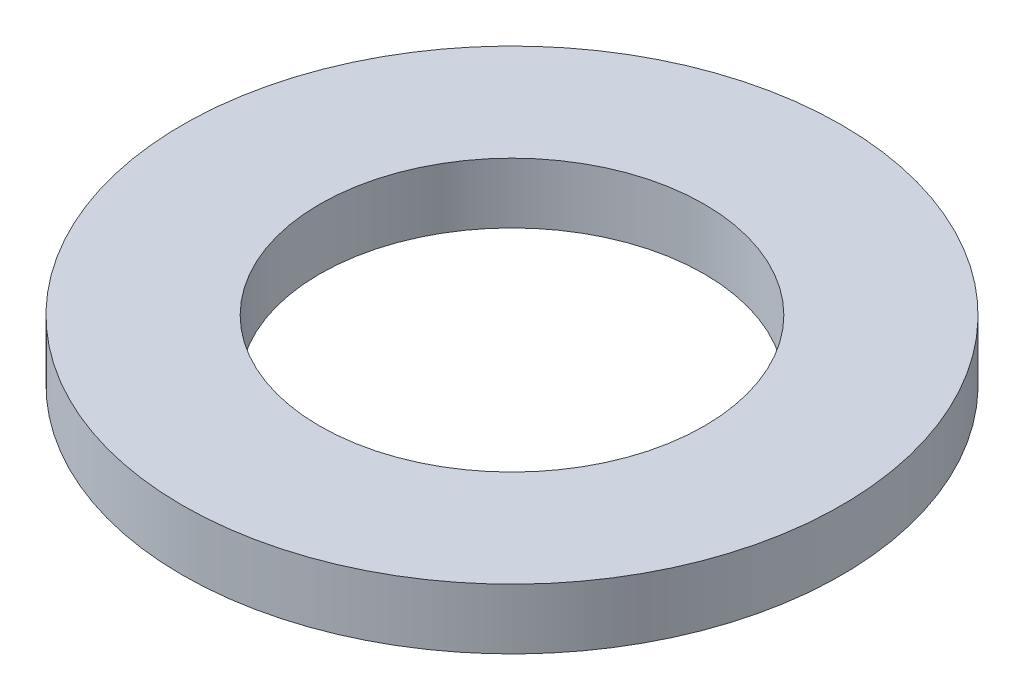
ISO-10303-21;
HEADER;
FILE_DESCRIPTION(('STEP AP214'),'2;1');
FILE_NAME('part.step','',(''),(''),'','','');
FILE_SCHEMA(('AUTOMOTIVE_DESIGN { 1 0 10303 214 1 1 1 1 }'));
ENDSEC;
DATA;
#1=APPLICATION_CONTEXT('core data for automotive mechanical design processes');
#2=APPLICATION_PROTOCOL_DEFINITION('international standard','automotive_design',2000,#1);
#3=PRODUCT_CONTEXT('',#1,'mechanical');
#4=PRODUCT('Part','Part','',(#3));
#5=PRODUCT_RELATED_PRODUCT_CATEGORY('part','',(#4));
#6=PRODUCT_DEFINITION_FORMATION('','',#4);
#7=PRODUCT_DEFINITION_CONTEXT('part definition',#1,'design');
#8=PRODUCT_DEFINITION('design','',#6,#7);
#9=PRODUCT_DEFINITION_SHAPE('','',#8);
#10=(LENGTH_UNIT() NAMED_UNIT(*) SI_UNIT(.MILLI.,.METRE.));
#11=(NAMED_UNIT(*) PLANE_ANGLE_UNIT() SI_UNIT($,.RADIAN.));
#12=(NAMED_UNIT(*) SI_UNIT($,.STERADIAN.) SOLID_ANGLE_UNIT());
#13=UNCERTAINTY_MEASURE_WITH_UNIT(LENGTH_MEASURE(1.E-05),#10,'distance_accuracy_value','');
#14=(GEOMETRIC_REPRESENTATION_CONTEXT(3) GLOBAL_UNCERTAINTY_ASSIGNED_CONTEXT((#13)) GLOBAL_UNIT_ASSIGNED_CONTEXT((#10,
#11,#12)) REPRESENTATION_CONTEXT('',''));
#15=CARTESIAN_POINT('',(0.,0.,0.));
#16=DIRECTION('',(0.,0.,1.));
#17=DIRECTION('',(1.,0.,0.));
#18=AXIS2_PLACEMENT_3D('',#15,#16,#17);
#19=CARTESIAN_POINT('',(0.,2.2,0.));
#20=DIRECTION('',(0.,1.,0.));
#21=DIRECTION('',(0.,0.,1.));
#22=AXIS2_PLACEMENT_3D('',#19,#20,#21);
#23=PLANE('',#22);
#24=CARTESIAN_POINT('',(0.,2.2,0.));
#25=DIRECTION('',(0.,1.,0.));
#26=DIRECTION('',(0.,0.,1.));
#27=AXIS2_PLACEMENT_3D('',#24,#25,#26);
#28=CIRCLE('',#27,12.);
#29=CARTESIAN_POINT('',(0.,2.2,12.));
#30=VERTEX_POINT('',#29);
#31=EDGE_CURVE('E10',#30,#30,#28,.T.);
#32=ORIENTED_EDGE('',*,*,#31,.T.);
#33=EDGE_LOOP('',(#32));
#34=FACE_BOUND('',#33,.T.);
#35=CARTESIAN_POINT('',(0.,2.2,0.));
#36=DIRECTION('',(0.,1.,0.));
#37=DIRECTION('',(0.,0.,1.));
#38=AXIS2_PLACEMENT_3D('',#35,#36,#37);
#39=CIRCLE('',#38,7.);
#40=CARTESIAN_POINT('',(0.,2.2,7.));
#41=VERTEX_POINT('',#40);
#42=EDGE_CURVE('E35',#41,#41,#39,.T.);
#43=ORIENTED_EDGE('',*,*,#42,.F.);
#44=EDGE_LOOP('',(#43));
#45=FACE_BOUND('',#44,.T.);
#46=ADVANCED_FACE('F24',(#34,#45),#23,.T.);
#47=CARTESIAN_POINT('',(0.,0.,0.));
#48=DIRECTION('',(0.,1.,0.));
#49=DIRECTION('',(0.,0.,1.));
#50=AXIS2_PLACEMENT_3D('',#47,#48,#49);
#51=PLANE('',#50);
#52=CARTESIAN_POINT('',(0.,0.,0.));
#53=DIRECTION('',(0.,1.,0.));
#54=DIRECTION('',(0.,0.,1.));
#55=AXIS2_PLACEMENT_3D('',#52,#53,#54);
#56=CIRCLE('',#55,12.);
#57=CARTESIAN_POINT('',(0.,0.,12.));
#58=VERTEX_POINT('',#57);
#59=EDGE_CURVE('E31',#58,#58,#56,.T.);
#60=ORIENTED_EDGE('',*,*,#59,.F.);
#61=EDGE_LOOP('',(#60));
#62=FACE_BOUND('',#61,.T.);
#63=CARTESIAN_POINT('',(0.,0.,0.));
#64=DIRECTION('',(0.,1.,0.));
#65=DIRECTION('',(0.,0.,1.));
#66=AXIS2_PLACEMENT_3D('',#63,#64,#65);
#67=CIRCLE('',#66,7.);
#68=CARTESIAN_POINT('',(0.,0.,7.));
#69=VERTEX_POINT('',#68);
#70=EDGE_CURVE('E39',#69,#69,#67,.T.);
#71=ORIENTED_EDGE('',*,*,#70,.T.);
#72=EDGE_LOOP('',(#71));
#73=FACE_BOUND('',#72,.T.);
#74=ADVANCED_FACE('F45',(#62,#73),#51,.F.);
#75=CARTESIAN_POINT('',(0.,2.2,0.));
#76=DIRECTION('',(0.,-1.,0.));
#77=DIRECTION('',(0.,0.,-1.));
#78=AXIS2_PLACEMENT_3D('',#75,#76,#77);
#79=CYLINDRICAL_SURFACE('',#78,12.);
#80=ORIENTED_EDGE('',*,*,#31,.F.);
#81=EDGE_LOOP('',(#80));
#82=FACE_BOUND('',#81,.T.);
#83=ORIENTED_EDGE('',*,*,#59,.T.);
#84=EDGE_LOOP('',(#83));
#85=FACE_BOUND('',#84,.T.);
#86=ADVANCED_FACE('F26',(#82,#85),#79,.T.);
#87=CARTESIAN_POINT('',(0.,2.2,0.));
#88=DIRECTION('',(0.,-1.,0.));
#89=DIRECTION('',(0.,0.,-1.));
#90=AXIS2_PLACEMENT_3D('',#87,#88,#89);
#91=CYLINDRICAL_SURFACE('',#90,7.);
#92=ORIENTED_EDGE('',*,*,#42,.T.);
#93=EDGE_LOOP('',(#92));
#94=FACE_BOUND('',#93,.T.);
#95=ORIENTED_EDGE('',*,*,#70,.F.);
#96=EDGE_LOOP('',(#95));
#97=FACE_BOUND('',#96,.T.);
#98=ADVANCED_FACE('F47',(#94,#97),#91,.F.);
#99=CLOSED_SHELL('',(#46,#74,#86,#98));
#100=MANIFOLD_SOLID_BREP('B2',#99);
#101=ADVANCED_BREP_SHAPE_REPRESENTATION('',(#18,#100),#14);
#102=SHAPE_DEFINITION_REPRESENTATION(#9,#101);
ENDSEC;
END-ISO-10303-21;
